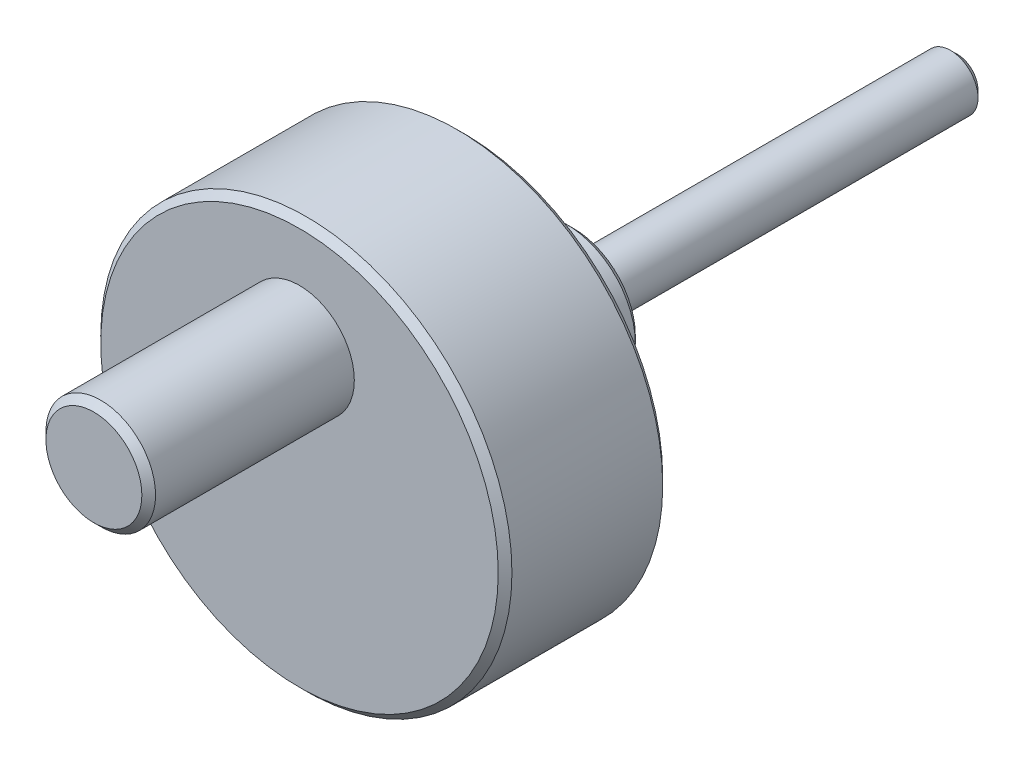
ISO-10303-21;
HEADER;
FILE_DESCRIPTION(('STEP AP214'),'2;1');
FILE_NAME('part.step','',(''),(''),'','','');
FILE_SCHEMA(('AUTOMOTIVE_DESIGN { 1 0 10303 214 1 1 1 1 }'));
ENDSEC;
DATA;
#1=APPLICATION_CONTEXT('core data for automotive mechanical design processes');
#2=APPLICATION_PROTOCOL_DEFINITION('international standard','automotive_design',2000,#1);
#3=PRODUCT_CONTEXT('',#1,'mechanical');
#4=PRODUCT('Part','Part','',(#3));
#5=PRODUCT_RELATED_PRODUCT_CATEGORY('part','',(#4));
#6=PRODUCT_DEFINITION_FORMATION('','',#4);
#7=PRODUCT_DEFINITION_CONTEXT('part definition',#1,'design');
#8=PRODUCT_DEFINITION('design','',#6,#7);
#9=PRODUCT_DEFINITION_SHAPE('','',#8);
#10=(LENGTH_UNIT() NAMED_UNIT(*) SI_UNIT(.MILLI.,.METRE.));
#11=(NAMED_UNIT(*) PLANE_ANGLE_UNIT() SI_UNIT($,.RADIAN.));
#12=(NAMED_UNIT(*) SI_UNIT($,.STERADIAN.) SOLID_ANGLE_UNIT());
#13=UNCERTAINTY_MEASURE_WITH_UNIT(LENGTH_MEASURE(1.E-05),#10,'distance_accuracy_value','');
#14=(GEOMETRIC_REPRESENTATION_CONTEXT(3) GLOBAL_UNCERTAINTY_ASSIGNED_CONTEXT((#13)) GLOBAL_UNIT_ASSIGNED_CONTEXT((#10,
#11,#12)) REPRESENTATION_CONTEXT('',''));
#15=CARTESIAN_POINT('',(0.,0.,0.));
#16=DIRECTION('',(0.,0.,1.));
#17=DIRECTION('',(1.,0.,0.));
#18=AXIS2_PLACEMENT_3D('',#15,#16,#17);
#19=CARTESIAN_POINT('',(0.,0.,14.));
#20=DIRECTION('',(0.,0.,-1.));
#21=DIRECTION('',(-1.,0.,0.));
#22=AXIS2_PLACEMENT_3D('',#19,#20,#21);
#23=CYLINDRICAL_SURFACE('',#22,1.);
#24=CARTESIAN_POINT('',(0.,0.,0.25));
#25=DIRECTION('',(0.,0.,1.));
#26=DIRECTION('',(1.,0.,0.));
#27=AXIS2_PLACEMENT_3D('',#24,#25,#26);
#28=CIRCLE('',#27,1.);
#29=CARTESIAN_POINT('',(1.,0.,0.25));
#30=VERTEX_POINT('',#29);
#31=EDGE_CURVE('E65',#30,#30,#28,.T.);
#32=ORIENTED_EDGE('',*,*,#31,.T.);
#33=EDGE_LOOP('',(#32));
#34=FACE_BOUND('',#33,.T.);
#35=CARTESIAN_POINT('',(0.,0.,14.));
#36=DIRECTION('',(0.,0.,1.));
#37=DIRECTION('',(1.,0.,0.));
#38=AXIS2_PLACEMENT_3D('',#35,#36,#37);
#39=CIRCLE('',#38,1.);
#40=CARTESIAN_POINT('',(1.,0.,14.));
#41=VERTEX_POINT('',#40);
#42=EDGE_CURVE('E68',#41,#41,#39,.T.);
#43=ORIENTED_EDGE('',*,*,#42,.F.);
#44=EDGE_LOOP('',(#43));
#45=FACE_BOUND('',#44,.T.);
#46=ADVANCED_FACE('F30',(#34,#45),#23,.T.);
#47=CARTESIAN_POINT('',(0.,0.,0.));
#48=DIRECTION('',(0.,0.,1.));
#49=DIRECTION('',(1.,0.,0.));
#50=AXIS2_PLACEMENT_3D('',#47,#48,#49);
#51=PLANE('',#50);
#52=CARTESIAN_POINT('',(0.,0.,0.));
#53=DIRECTION('',(0.,0.,1.));
#54=DIRECTION('',(1.,0.,0.));
#55=AXIS2_PLACEMENT_3D('',#52,#53,#54);
#56=CIRCLE('',#55,0.750000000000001);
#57=CARTESIAN_POINT('',(0.750000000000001,0.,0.));
#58=VERTEX_POINT('',#57);
#59=EDGE_CURVE('E62',#58,#58,#56,.F.);
#60=ORIENTED_EDGE('',*,*,#59,.T.);
#61=EDGE_LOOP('',(#60));
#62=FACE_BOUND('',#61,.T.);
#63=ADVANCED_FACE('F97',(#62),#51,.F.);
#64=CARTESIAN_POINT('',(0.,0.,18.));
#65=DIRECTION('',(0.,0.,-1.));
#66=DIRECTION('',(-1.,0.,0.));
#67=AXIS2_PLACEMENT_3D('',#64,#65,#66);
#68=CYLINDRICAL_SURFACE('',#67,2.5);
#69=CARTESIAN_POINT('',(0.,0.,14.25));
#70=DIRECTION('',(0.,0.,1.));
#71=DIRECTION('',(1.,0.,0.));
#72=AXIS2_PLACEMENT_3D('',#69,#70,#71);
#73=CIRCLE('',#72,2.5);
#74=CARTESIAN_POINT('',(2.5,0.,14.25));
#75=VERTEX_POINT('',#74);
#76=EDGE_CURVE('E37',#75,#75,#73,.T.);
#77=ORIENTED_EDGE('',*,*,#76,.T.);
#78=EDGE_LOOP('',(#77));
#79=FACE_BOUND('',#78,.T.);
#80=CARTESIAN_POINT('',(0.,0.,18.));
#81=DIRECTION('',(0.,0.,1.));
#82=DIRECTION('',(1.,0.,0.));
#83=AXIS2_PLACEMENT_3D('',#80,#81,#82);
#84=CIRCLE('',#83,2.5);
#85=CARTESIAN_POINT('',(2.5,0.,18.));
#86=VERTEX_POINT('',#85);
#87=EDGE_CURVE('E71',#86,#86,#84,.T.);
#88=ORIENTED_EDGE('',*,*,#87,.F.);
#89=EDGE_LOOP('',(#88));
#90=FACE_BOUND('',#89,.T.);
#91=ADVANCED_FACE('F103',(#79,#90),#68,.T.);
#92=CARTESIAN_POINT('',(0.,0.,14.));
#93=DIRECTION('',(0.,0.,1.));
#94=DIRECTION('',(1.,0.,0.));
#95=AXIS2_PLACEMENT_3D('',#92,#93,#94);
#96=PLANE('',#95);
#97=CARTESIAN_POINT('',(0.,0.,14.));
#98=DIRECTION('',(0.,0.,1.));
#99=DIRECTION('',(1.,0.,0.));
#100=AXIS2_PLACEMENT_3D('',#97,#98,#99);
#101=CIRCLE('',#100,2.25);
#102=CARTESIAN_POINT('',(2.25,0.,14.));
#103=VERTEX_POINT('',#102);
#104=EDGE_CURVE('E10',#103,#103,#101,.F.);
#105=ORIENTED_EDGE('',*,*,#104,.T.);
#106=EDGE_LOOP('',(#105));
#107=FACE_BOUND('',#106,.T.);
#108=ORIENTED_EDGE('',*,*,#42,.T.);
#109=EDGE_LOOP('',(#108));
#110=FACE_BOUND('',#109,.T.);
#111=ADVANCED_FACE('F92',(#107,#110),#96,.F.);
#112=CARTESIAN_POINT('',(0.,0.,24.));
#113=DIRECTION('',(0.,0.,-1.));
#114=DIRECTION('',(-1.,0.,0.));
#115=AXIS2_PLACEMENT_3D('',#112,#113,#114);
#116=CYLINDRICAL_SURFACE('',#115,7.5);
#117=CARTESIAN_POINT('',(0.,0.,23.75));
#118=DIRECTION('',(0.,0.,1.));
#119=DIRECTION('',(1.,0.,0.));
#120=AXIS2_PLACEMENT_3D('',#117,#118,#119);
#121=CIRCLE('',#120,7.5);
#122=CARTESIAN_POINT('',(7.5,0.,23.75));
#123=VERTEX_POINT('',#122);
#124=EDGE_CURVE('E45',#123,#123,#121,.F.);
#125=ORIENTED_EDGE('',*,*,#124,.T.);
#126=EDGE_LOOP('',(#125));
#127=FACE_BOUND('',#126,.T.);
#128=CARTESIAN_POINT('',(0.,0.,18.25));
#129=DIRECTION('',(0.,0.,1.));
#130=DIRECTION('',(1.,0.,0.));
#131=AXIS2_PLACEMENT_3D('',#128,#129,#130);
#132=CIRCLE('',#131,7.5);
#133=CARTESIAN_POINT('',(7.5,0.,18.25));
#134=VERTEX_POINT('',#133);
#135=EDGE_CURVE('E50',#134,#134,#132,.T.);
#136=ORIENTED_EDGE('',*,*,#135,.T.);
#137=EDGE_LOOP('',(#136));
#138=FACE_BOUND('',#137,.T.);
#139=ADVANCED_FACE('F83',(#127,#138),#116,.T.);
#140=CARTESIAN_POINT('',(0.,0.,24.));
#141=DIRECTION('',(0.,0.,1.));
#142=DIRECTION('',(1.,0.,0.));
#143=AXIS2_PLACEMENT_3D('',#140,#141,#142);
#144=PLANE('',#143);
#145=CARTESIAN_POINT('',(0.,0.,24.));
#146=DIRECTION('',(0.,0.,1.));
#147=DIRECTION('',(1.,0.,0.));
#148=AXIS2_PLACEMENT_3D('',#145,#146,#147);
#149=CIRCLE('',#148,7.25);
#150=CARTESIAN_POINT('',(7.25,0.,24.));
#151=VERTEX_POINT('',#150);
#152=EDGE_CURVE('E53',#151,#151,#149,.T.);
#153=ORIENTED_EDGE('',*,*,#152,.T.);
#154=EDGE_LOOP('',(#153));
#155=FACE_BOUND('',#154,.T.);
#156=CARTESIAN_POINT('',(0.,3.45,24.));
#157=DIRECTION('',(0.,0.,1.));
#158=DIRECTION('',(1.,0.,0.));
#159=AXIS2_PLACEMENT_3D('',#156,#157,#158);
#160=CIRCLE('',#159,2.);
#161=CARTESIAN_POINT('',(2.,3.45,24.));
#162=VERTEX_POINT('',#161);
#163=EDGE_CURVE('E74',#162,#162,#160,.T.);
#164=ORIENTED_EDGE('',*,*,#163,.F.);
#165=EDGE_LOOP('',(#164));
#166=FACE_BOUND('',#165,.T.);
#167=ADVANCED_FACE('F80',(#155,#166),#144,.T.);
#168=CARTESIAN_POINT('',(0.,0.,18.));
#169=DIRECTION('',(0.,0.,1.));
#170=DIRECTION('',(1.,0.,0.));
#171=AXIS2_PLACEMENT_3D('',#168,#169,#170);
#172=PLANE('',#171);
#173=CARTESIAN_POINT('',(0.,0.,18.));
#174=DIRECTION('',(0.,0.,1.));
#175=DIRECTION('',(1.,0.,0.));
#176=AXIS2_PLACEMENT_3D('',#173,#174,#175);
#177=CIRCLE('',#176,7.25);
#178=CARTESIAN_POINT('',(7.25,0.,18.));
#179=VERTEX_POINT('',#178);
#180=EDGE_CURVE('E41',#179,#179,#177,.F.);
#181=ORIENTED_EDGE('',*,*,#180,.T.);
#182=EDGE_LOOP('',(#181));
#183=FACE_BOUND('',#182,.T.);
#184=ORIENTED_EDGE('',*,*,#87,.T.);
#185=EDGE_LOOP('',(#184));
#186=FACE_BOUND('',#185,.T.);
#187=ADVANCED_FACE('F82',(#183,#186),#172,.F.);
#188=CARTESIAN_POINT('',(0.,3.45,31.5));
#189=DIRECTION('',(0.,0.,-1.));
#190=DIRECTION('',(-1.,0.,0.));
#191=AXIS2_PLACEMENT_3D('',#188,#189,#190);
#192=CYLINDRICAL_SURFACE('',#191,2.);
#193=CARTESIAN_POINT('',(0.,3.45,31.25));
#194=DIRECTION('',(0.,0.,1.));
#195=DIRECTION('',(1.,0.,0.));
#196=AXIS2_PLACEMENT_3D('',#193,#194,#195);
#197=CIRCLE('',#196,2.);
#198=CARTESIAN_POINT('',(2.,3.45,31.25));
#199=VERTEX_POINT('',#198);
#200=EDGE_CURVE('E56',#199,#199,#197,.F.);
#201=ORIENTED_EDGE('',*,*,#200,.T.);
#202=EDGE_LOOP('',(#201));
#203=FACE_BOUND('',#202,.T.);
#204=ORIENTED_EDGE('',*,*,#163,.T.);
#205=EDGE_LOOP('',(#204));
#206=FACE_BOUND('',#205,.T.);
#207=ADVANCED_FACE('F78',(#203,#206),#192,.T.);
#208=CARTESIAN_POINT('',(0.,3.45,31.5));
#209=DIRECTION('',(0.,0.,1.));
#210=DIRECTION('',(1.,0.,0.));
#211=AXIS2_PLACEMENT_3D('',#208,#209,#210);
#212=PLANE('',#211);
#213=CARTESIAN_POINT('',(0.,3.45,31.5));
#214=DIRECTION('',(0.,0.,1.));
#215=DIRECTION('',(1.,0.,0.));
#216=AXIS2_PLACEMENT_3D('',#213,#214,#215);
#217=CIRCLE('',#216,1.75);
#218=CARTESIAN_POINT('',(1.75,3.45,31.5));
#219=VERTEX_POINT('',#218);
#220=EDGE_CURVE('E59',#219,#219,#217,.T.);
#221=ORIENTED_EDGE('',*,*,#220,.T.);
#222=EDGE_LOOP('',(#221));
#223=FACE_BOUND('',#222,.T.);
#224=ADVANCED_FACE('F113',(#223),#212,.T.);
#225=CARTESIAN_POINT('',(0.,0.,0.25));
#226=DIRECTION('',(0.,0.,1.));
#227=DIRECTION('',(1.,0.,0.));
#228=AXIS2_PLACEMENT_3D('',#225,#226,#227);
#229=CONICAL_SURFACE('',#228,1.,0.785398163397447);
#230=ORIENTED_EDGE('',*,*,#59,.F.);
#231=EDGE_LOOP('',(#230));
#232=FACE_BOUND('',#231,.T.);
#233=ORIENTED_EDGE('',*,*,#31,.F.);
#234=EDGE_LOOP('',(#233));
#235=FACE_BOUND('',#234,.T.);
#236=ADVANCED_FACE('F109',(#232,#235),#229,.T.);
#237=CARTESIAN_POINT('',(0.,3.45,31.5));
#238=DIRECTION('',(0.,0.,-1.));
#239=DIRECTION('',(-1.,0.,0.));
#240=AXIS2_PLACEMENT_3D('',#237,#238,#239);
#241=CONICAL_SURFACE('',#240,1.75,0.785398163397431);
#242=ORIENTED_EDGE('',*,*,#200,.F.);
#243=EDGE_LOOP('',(#242));
#244=FACE_BOUND('',#243,.T.);
#245=ORIENTED_EDGE('',*,*,#220,.F.);
#246=EDGE_LOOP('',(#245));
#247=FACE_BOUND('',#246,.T.);
#248=ADVANCED_FACE('F112',(#244,#247),#241,.T.);
#249=CARTESIAN_POINT('',(0.,0.,24.));
#250=DIRECTION('',(0.,0.,-1.));
#251=DIRECTION('',(-1.,0.,0.));
#252=AXIS2_PLACEMENT_3D('',#249,#250,#251);
#253=CONICAL_SURFACE('',#252,7.25,0.785398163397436);
#254=ORIENTED_EDGE('',*,*,#124,.F.);
#255=EDGE_LOOP('',(#254));
#256=FACE_BOUND('',#255,.T.);
#257=ORIENTED_EDGE('',*,*,#152,.F.);
#258=EDGE_LOOP('',(#257));
#259=FACE_BOUND('',#258,.T.);
#260=ADVANCED_FACE('F117',(#256,#259),#253,.T.);
#261=CARTESIAN_POINT('',(0.,0.,18.25));
#262=DIRECTION('',(0.,0.,1.));
#263=DIRECTION('',(1.,0.,0.));
#264=AXIS2_PLACEMENT_3D('',#261,#262,#263);
#265=CONICAL_SURFACE('',#264,7.5,0.78539816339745);
#266=ORIENTED_EDGE('',*,*,#180,.F.);
#267=EDGE_LOOP('',(#266));
#268=FACE_BOUND('',#267,.T.);
#269=ORIENTED_EDGE('',*,*,#135,.F.);
#270=EDGE_LOOP('',(#269));
#271=FACE_BOUND('',#270,.T.);
#272=ADVANCED_FACE('F120',(#268,#271),#265,.T.);
#273=CARTESIAN_POINT('',(0.,0.,14.25));
#274=DIRECTION('',(0.,0.,1.));
#275=DIRECTION('',(1.,0.,0.));
#276=AXIS2_PLACEMENT_3D('',#273,#274,#275);
#277=CONICAL_SURFACE('',#276,2.5,0.785398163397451);
#278=ORIENTED_EDGE('',*,*,#104,.F.);
#279=EDGE_LOOP('',(#278));
#280=FACE_BOUND('',#279,.T.);
#281=ORIENTED_EDGE('',*,*,#76,.F.);
#282=EDGE_LOOP('',(#281));
#283=FACE_BOUND('',#282,.T.);
#284=ADVANCED_FACE('F32',(#280,#283),#277,.T.);
#285=CLOSED_SHELL('',(#46,#63,#91,#111,#139,#167,#187,#207,#224,#236,#248,#260,#272,#284));
#286=MANIFOLD_SOLID_BREP('B2',#285);
#287=ADVANCED_BREP_SHAPE_REPRESENTATION('',(#18,#286),#14);
#288=SHAPE_DEFINITION_REPRESENTATION(#9,#287);
ENDSEC;
END-ISO-10303-21;
